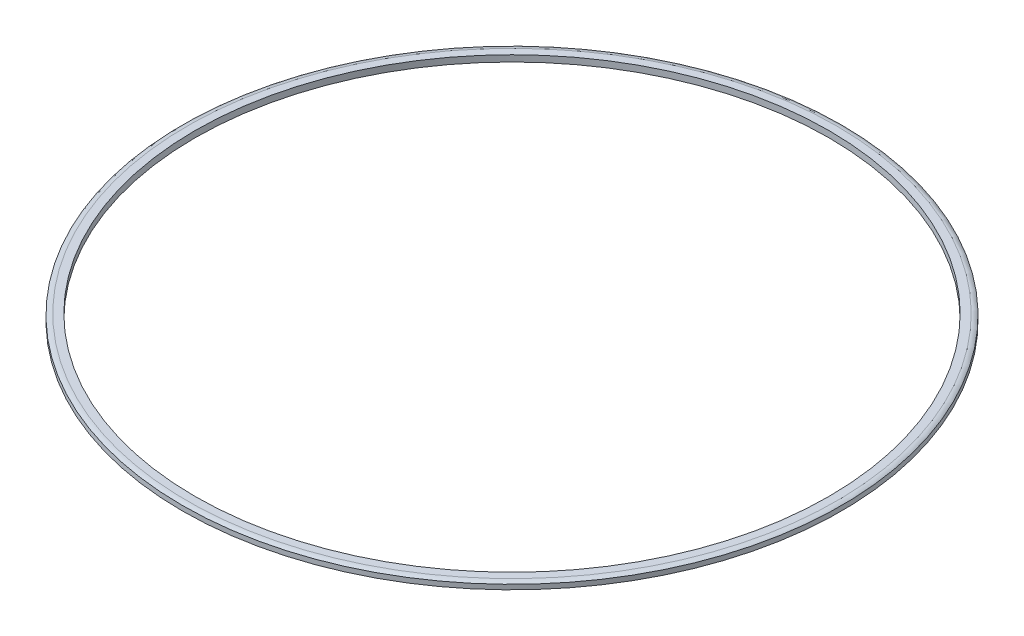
from build123d import *


with BuildPart() as part:
    # Esquisse1 → R_volution1 (revolve)
    with BuildSketch(Plane.XY, mode=Mode.PRIVATE) as r_volution1_sk:
        with BuildLine():
            Line((-300.911, 0), (-312.911, 0))
            Line((-312.911, 0), (-312.911, 4.555044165))
            ThreePointArc((-312.911, 4.555044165), (-310.729126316, 5.630214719), (-308.325, 6))
            Line((-308.325, 6), (-300.911, 6))
            Line((-300.911, 6), (-300.911, 0))
        make_face()
    revolve(r_volution1_sk.sketch.rotate(Axis((0, -40.811934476, 0), (0, 1, 0)), 270), axis=Axis((0, -40.811934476, 0), (0, 1, 0)))

    # Esquisse2 → Enl_vement de mati_re-R_volution1 (revolve, cut)
    with BuildSketch(Plane.XY, mode=Mode.PRIVATE) as enl_vement_de_mati_re_r_volution1_sk:
        Polygon((-305.871, 0), (-305.433875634, 2.479055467), (-308.388298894, 3), (-308.917279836, 0), align=None)
    revolve(enl_vement_de_mati_re_r_volution1_sk.sketch.rotate(Axis((0, 0, 0), (0, 1, 0)), 90), axis=Axis((0, 0, 0), (0, 1, 0)), mode=Mode.SUBTRACT)


solid = part.part
